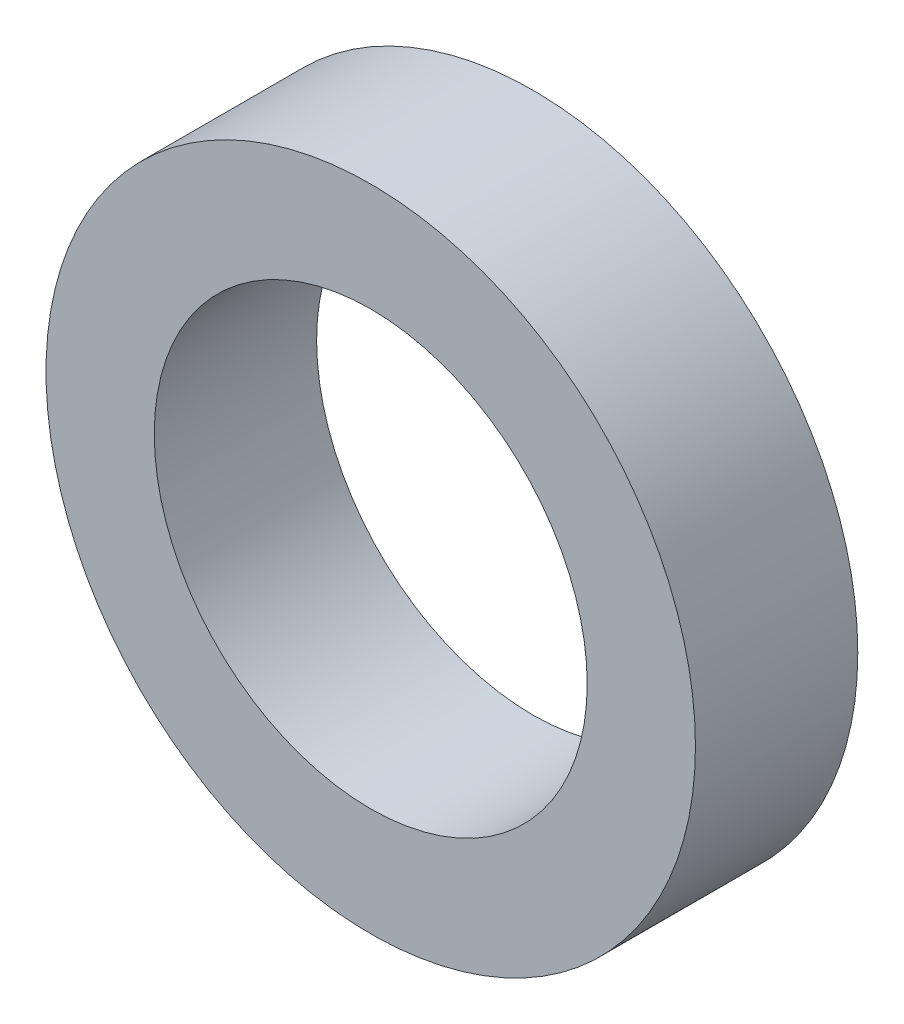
from build123d import *

# Parameters (mm, degrees)
ESQUISSE1_R        = 6
ESQUISSE1_R_2      = 4
BOSS_EXTRU_1_DEPTH = 3


with BuildPart() as part:
    # Esquisse1 → Boss.-Extru.1 (new body)
    with BuildSketch(Plane.XY):
        Circle(ESQUISSE1_R)
        Circle(ESQUISSE1_R_2, mode=Mode.SUBTRACT)
    extrude(amount=BOSS_EXTRU_1_DEPTH)


solid = part.part
